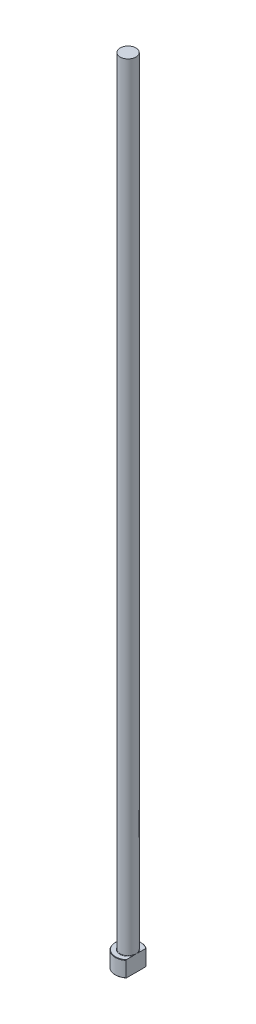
ISO-10303-21;
HEADER;
FILE_DESCRIPTION(('STEP AP214'),'2;1');
FILE_NAME('part.step','',(''),(''),'','','');
FILE_SCHEMA(('AUTOMOTIVE_DESIGN { 1 0 10303 214 1 1 1 1 }'));
ENDSEC;
DATA;
#1=APPLICATION_CONTEXT('core data for automotive mechanical design processes');
#2=APPLICATION_PROTOCOL_DEFINITION('international standard','automotive_design',2000,#1);
#3=PRODUCT_CONTEXT('',#1,'mechanical');
#4=PRODUCT('Part','Part','',(#3));
#5=PRODUCT_RELATED_PRODUCT_CATEGORY('part','',(#4));
#6=PRODUCT_DEFINITION_FORMATION('','',#4);
#7=PRODUCT_DEFINITION_CONTEXT('part definition',#1,'design');
#8=PRODUCT_DEFINITION('design','',#6,#7);
#9=PRODUCT_DEFINITION_SHAPE('','',#8);
#10=(LENGTH_UNIT() NAMED_UNIT(*) SI_UNIT(.MILLI.,.METRE.));
#11=(NAMED_UNIT(*) PLANE_ANGLE_UNIT() SI_UNIT($,.RADIAN.));
#12=(NAMED_UNIT(*) SI_UNIT($,.STERADIAN.) SOLID_ANGLE_UNIT());
#13=UNCERTAINTY_MEASURE_WITH_UNIT(LENGTH_MEASURE(1.E-05),#10,'distance_accuracy_value','');
#14=(GEOMETRIC_REPRESENTATION_CONTEXT(3) GLOBAL_UNCERTAINTY_ASSIGNED_CONTEXT((#13)) GLOBAL_UNIT_ASSIGNED_CONTEXT((#10,
#11,#12)) REPRESENTATION_CONTEXT('',''));
#15=CARTESIAN_POINT('',(0.,0.,0.));
#16=DIRECTION('',(0.,0.,1.));
#17=DIRECTION('',(1.,0.,0.));
#18=AXIS2_PLACEMENT_3D('',#15,#16,#17);
#19=CARTESIAN_POINT('',(0.,0.,0.));
#20=DIRECTION('',(0.,-1.,0.));
#21=DIRECTION('',(0.,0.,-1.));
#22=AXIS2_PLACEMENT_3D('',#19,#20,#21);
#23=PLANE('',#22);
#24=CARTESIAN_POINT('',(0.,0.,0.));
#25=DIRECTION('',(0.,-1.,0.));
#26=DIRECTION('',(0.,0.,-1.));
#27=AXIS2_PLACEMENT_3D('',#24,#25,#26);
#28=CIRCLE('',#27,6.30000000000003);
#29=CARTESIAN_POINT('',(3.99999999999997,0.,4.86723740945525));
#30=VERTEX_POINT('',#29);
#31=CARTESIAN_POINT('',(3.99999999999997,0.,-4.86723740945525));
#32=VERTEX_POINT('',#31);
#33=EDGE_CURVE('E98',#30,#32,#28,.T.);
#34=ORIENTED_EDGE('',*,*,#33,.T.);
#35=DIRECTION('',(0.,0.,1.));
#36=VECTOR('',#35,1.);
#37=CARTESIAN_POINT('',(3.99999999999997,0.,5.12347538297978));
#38=LINE('',#37,#36);
#39=EDGE_CURVE('E83',#32,#30,#38,.T.);
#40=ORIENTED_EDGE('',*,*,#39,.T.);
#41=EDGE_LOOP('',(#34,#40));
#42=FACE_BOUND('',#41,.T.);
#43=ADVANCED_FACE('F32',(#42),#23,.T.);
#44=CARTESIAN_POINT('',(0.,259.958771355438,0.));
#45=DIRECTION('',(0.,1.,0.));
#46=DIRECTION('',(0.,0.,1.));
#47=AXIS2_PLACEMENT_3D('',#44,#45,#46);
#48=CYLINDRICAL_SURFACE('',#47,6.49999999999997);
#49=CARTESIAN_POINT('',(0.,7.80000000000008,0.));
#50=DIRECTION('',(0.,1.,0.));
#51=DIRECTION('',(0.,0.,1.));
#52=AXIS2_PLACEMENT_3D('',#49,#50,#51);
#53=CIRCLE('',#52,6.49999999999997);
#54=CARTESIAN_POINT('',(3.99999999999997,7.80000000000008,5.12347538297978));
#55=VERTEX_POINT('',#54);
#56=CARTESIAN_POINT('',(3.99999999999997,7.80000000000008,-5.12347538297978));
#57=VERTEX_POINT('',#56);
#58=EDGE_CURVE('E104',#55,#57,#53,.F.);
#59=ORIENTED_EDGE('',*,*,#58,.T.);
#60=DIRECTION('',(0.,-1.,0.));
#61=VECTOR('',#60,1.);
#62=CARTESIAN_POINT('',(3.99999999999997,400.,-5.12347538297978));
#63=LINE('',#62,#61);
#64=CARTESIAN_POINT('',(3.99999999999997,0.199999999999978,-5.12347538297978));
#65=VERTEX_POINT('',#64);
#66=EDGE_CURVE('E183',#57,#65,#63,.T.);
#67=ORIENTED_EDGE('',*,*,#66,.T.);
#68=CARTESIAN_POINT('',(0.,0.199999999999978,0.));
#69=DIRECTION('',(0.,-1.,0.));
#70=DIRECTION('',(0.,0.,-1.));
#71=AXIS2_PLACEMENT_3D('',#68,#69,#70);
#72=CIRCLE('',#71,6.49999999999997);
#73=CARTESIAN_POINT('',(3.99999999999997,0.199999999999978,5.12347538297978));
#74=VERTEX_POINT('',#73);
#75=EDGE_CURVE('E100',#65,#74,#72,.F.);
#76=ORIENTED_EDGE('',*,*,#75,.T.);
#77=DIRECTION('',(0.,-1.,0.));
#78=VECTOR('',#77,1.);
#79=CARTESIAN_POINT('',(3.99999999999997,400.,5.12347538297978));
#80=LINE('',#79,#78);
#81=EDGE_CURVE('E93',#55,#74,#80,.T.);
#82=ORIENTED_EDGE('',*,*,#81,.F.);
#83=EDGE_LOOP('',(#59,#67,#76,#82));
#84=FACE_BOUND('',#83,.T.);
#85=ADVANCED_FACE('F158',(#84),#48,.T.);
#86=CARTESIAN_POINT('',(-6.49999999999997,8.,0.));
#87=DIRECTION('',(0.,1.,0.));
#88=DIRECTION('',(0.,0.,1.));
#89=AXIS2_PLACEMENT_3D('',#86,#87,#88);
#90=PLANE('',#89);
#91=CARTESIAN_POINT('',(0.,8.,0.));
#92=DIRECTION('',(0.,1.,0.));
#93=DIRECTION('',(0.,0.,1.));
#94=AXIS2_PLACEMENT_3D('',#91,#92,#93);
#95=CIRCLE('',#94,6.30000000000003);
#96=CARTESIAN_POINT('',(3.99999999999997,8.,-4.86723740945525));
#97=VERTEX_POINT('',#96);
#98=CARTESIAN_POINT('',(3.99999999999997,8.,4.86723740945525));
#99=VERTEX_POINT('',#98);
#100=EDGE_CURVE('E178',#97,#99,#95,.T.);
#101=ORIENTED_EDGE('',*,*,#100,.T.);
#102=DIRECTION('',(0.,0.,-1.));
#103=VECTOR('',#102,1.);
#104=CARTESIAN_POINT('',(3.99999999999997,8.,0.));
#105=LINE('',#104,#103);
#106=CARTESIAN_POINT('',(3.99999999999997,7.99999999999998,1.28062484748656));
#107=VERTEX_POINT('',#106);
#108=EDGE_CURVE('E57',#99,#107,#105,.T.);
#109=ORIENTED_EDGE('',*,*,#108,.T.);
#110=CARTESIAN_POINT('',(0.,8.,0.));
#111=DIRECTION('',(0.,1.,0.));
#112=DIRECTION('',(0.,0.,1.));
#113=AXIS2_PLACEMENT_3D('',#110,#111,#112);
#114=CIRCLE('',#113,4.19999999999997);
#115=CARTESIAN_POINT('',(3.99999999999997,7.99999999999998,-1.28062484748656));
#116=VERTEX_POINT('',#115);
#117=EDGE_CURVE('E107',#107,#116,#114,.F.);
#118=ORIENTED_EDGE('',*,*,#117,.T.);
#119=EDGE_CURVE('E136',#116,#97,#105,.T.);
#120=ORIENTED_EDGE('',*,*,#119,.T.);
#121=EDGE_LOOP('',(#101,#109,#118,#120));
#122=FACE_BOUND('',#121,.T.);
#123=ADVANCED_FACE('F147',(#122),#90,.T.);
#124=CARTESIAN_POINT('',(0.,8.00000000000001,0.));
#125=DIRECTION('',(0.,-1.,0.));
#126=DIRECTION('',(0.,0.,-1.));
#127=AXIS2_PLACEMENT_3D('',#124,#125,#126);
#128=CONICAL_SURFACE('',#127,6.30000000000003,0.785398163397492);
#129=ORIENTED_EDGE('',*,*,#58,.F.);
#130=CARTESIAN_POINT('',(3.99999999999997,2.33835680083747,11.2730168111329));
#131=CARTESIAN_POINT('',(3.99999999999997,2.5075110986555,11.0935258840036));
#132=CARTESIAN_POINT('',(3.99999999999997,2.67643005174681,10.9138129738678));
#133=CARTESIAN_POINT('',(3.99999999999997,3.01371694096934,10.5538688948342));
#134=CARTESIAN_POINT('',(3.99999999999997,3.1820848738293,10.3736377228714));
#135=CARTESIAN_POINT('',(3.99999999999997,3.68651578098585,9.83176085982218));
#136=CARTESIAN_POINT('',(3.99999999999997,4.02162663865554,9.46922758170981));
#137=CARTESIAN_POINT('',(3.99999999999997,4.69839264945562,8.73004878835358));
#138=CARTESIAN_POINT('',(3.99999999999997,5.03994227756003,8.35330632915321));
#139=CARTESIAN_POINT('',(3.99999999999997,5.54813444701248,7.78474717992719));
#140=CARTESIAN_POINT('',(3.99999999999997,5.71678224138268,7.59472329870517));
#141=CARTESIAN_POINT('',(3.99999999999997,6.05243048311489,7.21322727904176));
#142=CARTESIAN_POINT('',(3.99999999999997,6.21943094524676,7.02175515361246));
#143=CARTESIAN_POINT('',(3.99999999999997,6.55125779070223,6.63720143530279));
#144=CARTESIAN_POINT('',(3.99999999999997,6.71608581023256,6.44412125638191));
#145=CARTESIAN_POINT('',(3.99999999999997,7.04317390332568,6.05578163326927));
#146=CARTESIAN_POINT('',(3.99999999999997,7.20543388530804,5.86052211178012));
#147=CARTESIAN_POINT('',(3.99999999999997,7.5270272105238,5.46681806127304));
#148=CARTESIAN_POINT('',(3.99999999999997,7.68635259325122,5.26836701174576));
#149=CARTESIAN_POINT('',(3.99999999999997,8.0006074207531,4.86803282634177));
#150=CARTESIAN_POINT('',(3.99999999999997,8.15553731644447,4.66615004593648));
#151=CARTESIAN_POINT('',(3.99999999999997,8.45751575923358,4.26060182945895));
#152=CARTESIAN_POINT('',(3.99999999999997,8.60464039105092,4.05699334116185));
#153=CARTESIAN_POINT('',(3.99999999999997,8.89099959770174,3.64409822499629));
#154=CARTESIAN_POINT('',(3.99999999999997,9.0302302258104,3.43480883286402));
#155=CARTESIAN_POINT('',(3.99999999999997,9.2967735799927,3.00991388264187));
#156=CARTESIAN_POINT('',(3.99999999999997,9.42413322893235,2.79433803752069));
#157=CARTESIAN_POINT('',(3.99999999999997,9.66227069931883,2.35430355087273));
#158=CARTESIAN_POINT('',(3.99999999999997,9.77306978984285,2.12985677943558));
#159=CARTESIAN_POINT('',(3.99999999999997,9.92324174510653,1.77981866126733));
#160=CARTESIAN_POINT('',(3.99999999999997,9.97150219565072,1.65804958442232));
#161=CARTESIAN_POINT('',(3.99999999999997,10.0598239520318,1.41150602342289));
#162=CARTESIAN_POINT('',(3.99999999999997,10.0998835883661,1.28673093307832));
#163=CARTESIAN_POINT('',(3.99999999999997,10.1699893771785,1.03512545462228));
#164=CARTESIAN_POINT('',(3.99999999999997,10.2000910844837,0.908310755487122));
#165=CARTESIAN_POINT('',(3.99999999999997,10.2490705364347,0.65251155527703));
#166=CARTESIAN_POINT('',(3.99999999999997,10.2679495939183,0.523527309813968));
#167=CARTESIAN_POINT('',(3.99999999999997,10.2934980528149,0.262809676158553));
#168=CARTESIAN_POINT('',(3.99999999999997,10.3000223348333,0.13106177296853));
#169=CARTESIAN_POINT('',(3.99999999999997,10.2999775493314,-0.132423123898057));
#170=CARTESIAN_POINT('',(3.99999999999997,10.2934092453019,-0.264160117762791));
#171=CARTESIAN_POINT('',(3.99999999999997,10.2675780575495,-0.526867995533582));
#172=CARTESIAN_POINT('',(3.99999999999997,10.2482669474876,-0.65783405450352));
#173=CARTESIAN_POINT('',(3.99999999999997,10.1980980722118,-0.917527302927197));
#174=CARTESIAN_POINT('',(3.99999999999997,10.1672371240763,-1.04625386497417));
#175=CARTESIAN_POINT('',(3.99999999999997,10.0805844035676,-1.35405733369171));
#176=CARTESIAN_POINT('',(3.99999999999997,10.0197633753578,-1.5317103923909));
#177=CARTESIAN_POINT('',(3.99999999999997,9.88274788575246,-1.88095872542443));
#178=CARTESIAN_POINT('',(3.99999999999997,9.80654370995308,-2.05255009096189));
#179=CARTESIAN_POINT('',(3.99999999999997,9.68319777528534,-2.30659899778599));
#180=CARTESIAN_POINT('',(3.99999999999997,9.6403195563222,-2.39117275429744));
#181=CARTESIAN_POINT('',(3.99999999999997,9.55202002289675,-2.55898629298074));
#182=CARTESIAN_POINT('',(3.99999999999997,9.50659867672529,-2.64222605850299));
#183=CARTESIAN_POINT('',(3.99999999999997,9.41358656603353,-2.80743574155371));
#184=CARTESIAN_POINT('',(3.99999999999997,9.36599667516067,-2.88940615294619));
#185=CARTESIAN_POINT('',(3.99999999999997,9.26892422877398,-3.05220990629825));
#186=CARTESIAN_POINT('',(3.99999999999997,9.21944176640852,-3.13304330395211));
#187=CARTESIAN_POINT('',(3.99999999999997,9.04529267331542,-3.41112924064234));
#188=CARTESIAN_POINT('',(3.99999999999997,8.91648308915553,-3.60579191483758));
#189=CARTESIAN_POINT('',(3.99999999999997,8.65175618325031,-3.99024288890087));
#190=CARTESIAN_POINT('',(3.99999999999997,8.51583685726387,-4.18002979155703));
#191=CARTESIAN_POINT('',(3.99999999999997,8.23863283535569,-4.55590680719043));
#192=CARTESIAN_POINT('',(3.99999999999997,8.09734319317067,-4.74199325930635));
#193=CARTESIAN_POINT('',(3.99999999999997,7.81082146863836,-5.11106130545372));
#194=CARTESIAN_POINT('',(3.99999999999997,7.6655898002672,-5.2940432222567));
#195=CARTESIAN_POINT('',(3.99999999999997,7.37148704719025,-5.65825720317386));
#196=CARTESIAN_POINT('',(3.99999999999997,7.22260377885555,-5.83947940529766));
#197=CARTESIAN_POINT('',(3.99999999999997,6.92240731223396,-6.19990198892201));
#198=CARTESIAN_POINT('',(3.99999999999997,6.77109406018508,-6.3791023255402));
#199=CARTESIAN_POINT('',(3.99999999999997,6.31443192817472,-6.9140438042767));
#200=CARTESIAN_POINT('',(3.99999999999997,6.00619978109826,-7.26732233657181));
#201=CARTESIAN_POINT('',(3.99999999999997,5.42019779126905,-7.92915827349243));
#202=CARTESIAN_POINT('',(3.99999999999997,5.1429789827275,-8.23820650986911));
#203=CARTESIAN_POINT('',(3.99999999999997,4.58554936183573,-8.85367584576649));
#204=CARTESIAN_POINT('',(3.99999999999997,4.30533810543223,-9.16009654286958));
#205=CARTESIAN_POINT('',(3.99999999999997,3.74491435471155,-9.76850943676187));
#206=CARTESIAN_POINT('',(3.99999999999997,3.46471907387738,-10.0705175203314));
#207=CARTESIAN_POINT('',(3.99999999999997,2.90267484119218,-10.6728856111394));
#208=CARTESIAN_POINT('',(3.99999999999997,2.62082621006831,-10.9732459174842));
#209=CARTESIAN_POINT('',(3.99999999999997,2.33835680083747,-11.2730168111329));
#210=B_SPLINE_CURVE_WITH_KNOTS('',3,(#130,#131,#132,#133,#134,#135,#136,#137,#138,#139,#140,
#141,#142,#143,#144,#145,#146,#147,#148,#149,#150,#151,#152,#153,#154,#155,#156,#157,#158,#159,
#160,#161,#162,#163,#164,#165,#166,#167,#168,#169,#170,#171,#172,#173,#174,#175,#176,#177,#178,
#179,#180,#181,#182,#183,#184,#185,#186,#187,#188,#189,#190,#191,#192,#193,#194,#195,#196,#197,
#198,#199,#200,#201,#202,#203,#204,#205,#206,#207,#208,#209),.UNSPECIFIED.,.F.,.F.,(4,2,2,2,2,2,
2,2,2,2,2,2,2,2,2,2,2,2,2,2,2,2,2,2,2,2,2,2,2,2,2,2,2,2,2,2,2,2,2,4),(0.,0.739913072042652,
1.47983052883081,2.96088564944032,4.486400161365,5.24860048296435,6.0107939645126,
6.77237616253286,7.53398545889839,8.29742301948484,9.06078197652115,9.8142547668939,
10.5681010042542,11.3188284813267,12.0685833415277,12.4613034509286,12.854103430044,
13.2446735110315,13.6351978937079,14.0302815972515,14.4253422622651,14.8219067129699,
15.218580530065,15.7809161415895,16.3436079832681,16.6280404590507,16.9124764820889,
17.1967989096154,17.481107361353,18.1811169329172,18.8813249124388,19.5821942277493,
20.2829902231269,20.9865751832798,21.6901757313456,23.0966141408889,24.3420866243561,
25.5877465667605,26.8236460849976,28.0593133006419),.UNSPECIFIED.);
#211=EDGE_CURVE('E135',#55,#99,#210,.T.);
#212=ORIENTED_EDGE('',*,*,#211,.T.);
#213=ORIENTED_EDGE('',*,*,#100,.F.);
#214=EDGE_CURVE('E127',#97,#57,#210,.T.);
#215=ORIENTED_EDGE('',*,*,#214,.T.);
#216=EDGE_LOOP('',(#129,#212,#213,#215));
#217=FACE_BOUND('',#216,.T.);
#218=ADVANCED_FACE('F143',(#217),#128,.T.);
#219=CARTESIAN_POINT('',(0.,0.199999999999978,0.));
#220=DIRECTION('',(0.,1.,0.));
#221=DIRECTION('',(0.,0.,1.));
#222=AXIS2_PLACEMENT_3D('',#219,#220,#221);
#223=CONICAL_SURFACE('',#222,6.49999999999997,0.785398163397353);
#224=ORIENTED_EDGE('',*,*,#75,.F.);
#225=CARTESIAN_POINT('',(3.99999999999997,5.66164319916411,-11.2730168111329));
#226=CARTESIAN_POINT('',(3.99999999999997,5.49248890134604,-11.0935258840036));
#227=CARTESIAN_POINT('',(3.99999999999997,5.32356994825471,-10.9138129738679));
#228=CARTESIAN_POINT('',(3.99999999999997,4.9862830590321,-10.5538688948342));
#229=CARTESIAN_POINT('',(3.99999999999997,4.81791512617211,-10.3736377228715));
#230=CARTESIAN_POINT('',(3.99999999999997,4.31348421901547,-9.8317608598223));
#231=CARTESIAN_POINT('',(3.99999999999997,3.97837336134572,-9.46922758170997));
#232=CARTESIAN_POINT('',(3.99999999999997,3.30160735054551,-8.73004878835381));
#233=CARTESIAN_POINT('',(3.99999999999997,2.96005772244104,-8.35330632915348));
#234=CARTESIAN_POINT('',(3.99999999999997,2.45186555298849,-7.78474717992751));
#235=CARTESIAN_POINT('',(3.99999999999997,2.28321775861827,-7.59472329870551));
#236=CARTESIAN_POINT('',(3.99999999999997,1.94756951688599,-7.21322727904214));
#237=CARTESIAN_POINT('',(3.99999999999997,1.78056905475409,-7.02175515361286));
#238=CARTESIAN_POINT('',(3.99999999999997,1.44874220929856,-6.63720143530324));
#239=CARTESIAN_POINT('',(3.99999999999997,1.2839141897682,-6.44412125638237));
#240=CARTESIAN_POINT('',(3.99999999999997,0.956826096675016,-6.05578163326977));
#241=CARTESIAN_POINT('',(3.99999999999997,0.794566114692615,-5.86052211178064));
#242=CARTESIAN_POINT('',(3.99999999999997,0.472972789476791,-5.4668180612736));
#243=CARTESIAN_POINT('',(3.99999999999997,0.313647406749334,-5.26836701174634));
#244=CARTESIAN_POINT('',(3.99999999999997,-0.000607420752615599,-4.86803282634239));
#245=CARTESIAN_POINT('',(3.99999999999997,-0.155537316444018,-4.66615004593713));
#246=CARTESIAN_POINT('',(3.99999999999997,-0.457515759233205,-4.26060182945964));
#247=CARTESIAN_POINT('',(3.99999999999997,-0.604640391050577,-4.05699334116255));
#248=CARTESIAN_POINT('',(3.99999999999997,-0.890999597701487,-3.64409822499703));
#249=CARTESIAN_POINT('',(3.99999999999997,-1.03023022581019,-3.43480883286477));
#250=CARTESIAN_POINT('',(3.99999999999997,-1.29677357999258,-3.00991388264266));
#251=CARTESIAN_POINT('',(3.99999999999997,-1.42413322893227,-2.7943380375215));
#252=CARTESIAN_POINT('',(3.99999999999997,-1.66227069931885,-2.35430355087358));
#253=CARTESIAN_POINT('',(3.99999999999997,-1.77306978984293,-2.12985677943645));
#254=CARTESIAN_POINT('',(3.99999999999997,-1.92324174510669,-1.77981866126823));
#255=CARTESIAN_POINT('',(3.99999999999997,-1.97150219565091,-1.65804958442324));
#256=CARTESIAN_POINT('',(3.99999999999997,-2.05982395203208,-1.41150602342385));
#257=CARTESIAN_POINT('',(3.99999999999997,-2.09988358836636,-1.28673093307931));
#258=CARTESIAN_POINT('',(3.99999999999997,-2.16998937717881,-1.03512545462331));
#259=CARTESIAN_POINT('',(3.99999999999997,-2.20009108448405,-0.908310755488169));
#260=CARTESIAN_POINT('',(3.99999999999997,-2.24907053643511,-0.652511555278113));
#261=CARTESIAN_POINT('',(3.99999999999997,-2.26794959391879,-0.523527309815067));
#262=CARTESIAN_POINT('',(3.99999999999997,-2.29349805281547,-0.262809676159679));
#263=CARTESIAN_POINT('',(3.99999999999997,-2.30002233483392,-0.131061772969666));
#264=CARTESIAN_POINT('',(3.99999999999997,-2.29997754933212,0.132423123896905));
#265=CARTESIAN_POINT('',(3.99999999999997,-2.29340924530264,0.264160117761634));
#266=CARTESIAN_POINT('',(3.99999999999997,-2.26757805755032,0.526867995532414));
#267=CARTESIAN_POINT('',(3.99999999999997,-2.24826694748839,0.657834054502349));
#268=CARTESIAN_POINT('',(3.99999999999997,-2.19809807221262,0.917527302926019));
#269=CARTESIAN_POINT('',(3.99999999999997,-2.16723712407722,1.04625386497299));
#270=CARTESIAN_POINT('',(3.99999999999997,-2.08058440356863,1.35405733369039));
#271=CARTESIAN_POINT('',(3.99999999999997,-2.01976337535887,1.53171039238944));
#272=CARTESIAN_POINT('',(3.99999999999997,-1.8827478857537,1.88095872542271));
#273=CARTESIAN_POINT('',(3.99999999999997,-1.80654370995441,2.05255009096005));
#274=CARTESIAN_POINT('',(3.99999999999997,-1.68319777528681,2.30659899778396));
#275=CARTESIAN_POINT('',(3.99999999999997,-1.64031955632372,2.39117275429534));
#276=CARTESIAN_POINT('',(3.99999999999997,-1.55202002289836,2.55898629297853));
#277=CARTESIAN_POINT('',(3.99999999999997,-1.50659867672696,2.64222605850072));
#278=CARTESIAN_POINT('',(3.99999999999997,-1.41358656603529,2.80743574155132));
#279=CARTESIAN_POINT('',(3.99999999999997,-1.36599667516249,2.88940615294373));
#280=CARTESIAN_POINT('',(3.99999999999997,-1.26892422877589,3.05220990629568));
#281=CARTESIAN_POINT('',(3.99999999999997,-1.21944176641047,3.13304330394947));
#282=CARTESIAN_POINT('',(3.99999999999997,-1.04529267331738,3.41112924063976));
#283=CARTESIAN_POINT('',(3.99999999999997,-0.916483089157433,3.60579191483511));
#284=CARTESIAN_POINT('',(3.99999999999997,-0.651756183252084,3.99024288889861));
#285=CARTESIAN_POINT('',(3.99999999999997,-0.515836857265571,4.18002979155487));
#286=CARTESIAN_POINT('',(3.99999999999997,-0.238632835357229,4.55590680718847));
#287=CARTESIAN_POINT('',(3.99999999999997,-0.0973431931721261,4.74199325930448));
#288=CARTESIAN_POINT('',(3.99999999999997,0.189178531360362,5.11106130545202));
#289=CARTESIAN_POINT('',(3.99999999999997,0.334410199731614,5.2940432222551));
#290=CARTESIAN_POINT('',(3.99999999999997,0.628512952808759,5.65825720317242));
#291=CARTESIAN_POINT('',(3.99999999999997,0.777396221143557,5.83947940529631));
#292=CARTESIAN_POINT('',(3.99999999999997,1.07759268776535,6.19990198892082));
#293=CARTESIAN_POINT('',(3.99999999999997,1.22890593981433,6.37910232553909));
#294=CARTESIAN_POINT('',(3.99999999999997,1.685568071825,6.91404380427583));
#295=CARTESIAN_POINT('',(3.99999999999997,1.99380021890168,7.26732233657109));
#296=CARTESIAN_POINT('',(3.99999999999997,2.57980220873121,7.92915827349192));
#297=CARTESIAN_POINT('',(3.99999999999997,2.85702101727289,8.23820650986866));
#298=CARTESIAN_POINT('',(3.99999999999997,3.4144506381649,8.85367584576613));
#299=CARTESIAN_POINT('',(3.99999999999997,3.69466189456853,9.16009654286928));
#300=CARTESIAN_POINT('',(3.99999999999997,4.25508564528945,9.76850943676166));
#301=CARTESIAN_POINT('',(3.99999999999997,4.53528092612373,10.0705175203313));
#302=CARTESIAN_POINT('',(3.99999999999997,5.09732515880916,10.6728856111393));
#303=CARTESIAN_POINT('',(3.99999999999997,5.37917378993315,10.9732459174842));
#304=CARTESIAN_POINT('',(3.99999999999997,5.66164319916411,11.2730168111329));
#305=B_SPLINE_CURVE_WITH_KNOTS('',3,(#225,#226,#227,#228,#229,#230,#231,#232,#233,#234,#235,
#236,#237,#238,#239,#240,#241,#242,#243,#244,#245,#246,#247,#248,#249,#250,#251,#252,#253,#254,
#255,#256,#257,#258,#259,#260,#261,#262,#263,#264,#265,#266,#267,#268,#269,#270,#271,#272,#273,
#274,#275,#276,#277,#278,#279,#280,#281,#282,#283,#284,#285,#286,#287,#288,#289,#290,#291,#292,
#293,#294,#295,#296,#297,#298,#299,#300,#301,#302,#303,#304),.UNSPECIFIED.,.F.,.F.,(4,2,2,2,2,2,
2,2,2,2,2,2,2,2,2,2,2,2,2,2,2,2,2,2,2,2,2,2,2,2,2,2,2,2,2,2,2,2,2,4),(0.,0.739913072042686,
1.47983052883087,2.96088564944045,4.48640016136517,5.24860048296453,6.0107939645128,
6.77237616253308,7.53398545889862,8.29742301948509,9.06078197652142,9.81425476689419,
10.5681010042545,11.3188284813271,12.0685833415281,12.4613034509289,12.8541034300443,
13.2446735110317,13.6351978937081,14.0302815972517,14.4253422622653,14.8219067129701,
15.2185805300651,15.7809161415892,16.3436079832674,16.6280404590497,16.9124764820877,
17.196798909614,17.4811073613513,18.1811169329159,18.8813249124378,19.5821942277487,
20.2829902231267,20.98657518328,21.6901757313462,23.0966141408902,24.3420866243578,
25.5877465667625,26.823646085,28.0593133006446),.UNSPECIFIED.);
#306=EDGE_CURVE('E86',#65,#32,#305,.T.);
#307=ORIENTED_EDGE('',*,*,#306,.T.);
#308=ORIENTED_EDGE('',*,*,#33,.F.);
#309=EDGE_CURVE('E89',#30,#74,#305,.T.);
#310=ORIENTED_EDGE('',*,*,#309,.T.);
#311=EDGE_LOOP('',(#224,#307,#308,#310));
#312=FACE_BOUND('',#311,.T.);
#313=ADVANCED_FACE('F97',(#312),#223,.T.);
#314=CARTESIAN_POINT('',(0.,8.19999999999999,0.));
#315=DIRECTION('',(0.,1.,0.));
#316=DIRECTION('',(0.,0.,1.));
#317=AXIS2_PLACEMENT_3D('',#314,#315,#316);
#318=TOROIDAL_SURFACE('',#317,4.19999999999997,0.2);
#319=CARTESIAN_POINT('',(3.99999999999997,8.19999999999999,0.));
#320=CARTESIAN_POINT('',(3.99999999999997,8.20000051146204,6.54993054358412E-12));
#321=CARTESIAN_POINT('',(3.99999999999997,8.20000102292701,-2.33849533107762E-07));
#322=CARTESIAN_POINT('',(3.99999999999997,8.20000197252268,-8.59106931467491E-07));
#323=CARTESIAN_POINT('',(3.99999999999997,8.20000239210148,-1.26721109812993E-06));
#324=CARTESIAN_POINT('',(3.99999999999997,8.20000328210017,-2.25074280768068E-06));
#325=CARTESIAN_POINT('',(3.99999999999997,8.20000373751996,-2.84212519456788E-06));
#326=CARTESIAN_POINT('',(3.99999999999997,8.20000453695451,-4.05328052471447E-06));
#327=CARTESIAN_POINT('',(3.99999999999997,8.20000488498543,-4.67066382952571E-06));
#328=CARTESIAN_POINT('',(3.99999999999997,8.20000621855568,-7.11716611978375E-06));
#329=CARTESIAN_POINT('',(3.99999999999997,8.20000713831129,-8.98558487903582E-06));
#330=CARTESIAN_POINT('',(3.99999999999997,8.20000861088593,-1.26418243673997E-05));
#331=CARTESIAN_POINT('',(3.99999999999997,8.2000091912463,-1.44189480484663E-05));
#332=CARTESIAN_POINT('',(3.99999999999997,8.20001169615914,-2.20915838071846E-05));
#333=CARTESIAN_POINT('',(3.99999999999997,8.20001361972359,-2.79894750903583E-05));
#334=CARTESIAN_POINT('',(3.99999999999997,8.20001638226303,-3.90228536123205E-05));
#335=CARTESIAN_POINT('',(3.99999999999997,8.20001734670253,-4.41264580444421E-05));
#336=CARTESIAN_POINT('',(3.99999999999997,8.20002447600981,-8.24800902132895E-05));
#337=CARTESIAN_POINT('',(3.99999999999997,8.20003000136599,-0.000115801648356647));
#338=CARTESIAN_POINT('',(3.99999999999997,8.2000541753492,-0.000248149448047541));
#339=CARTESIAN_POINT('',(3.99999999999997,8.200077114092,-0.000346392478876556));
#340=CARTESIAN_POINT('',(3.99999999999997,8.20016695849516,-0.000737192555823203));
#341=CARTESIAN_POINT('',(3.99999999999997,8.20023118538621,-0.00103015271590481));
#342=CARTESIAN_POINT('',(3.99999999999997,8.20048943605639,-0.00220000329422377));
#343=CARTESIAN_POINT('',(3.99999999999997,8.20068689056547,-0.00307635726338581));
#344=CARTESIAN_POINT('',(3.99999999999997,8.20151245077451,-0.00674945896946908));
#345=CARTESIAN_POINT('',(3.99999999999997,8.20213623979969,-0.00954688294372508));
#346=CARTESIAN_POINT('',(3.99999999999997,8.21069858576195,-0.0479346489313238));
#347=CARTESIAN_POINT('',(3.99999999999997,8.21866411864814,-0.0835210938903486));
#348=CARTESIAN_POINT('',(3.99999999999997,8.23536251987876,-0.158673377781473));
#349=CARTESIAN_POINT('',(3.99999999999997,8.24408230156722,-0.198242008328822));
#350=CARTESIAN_POINT('',(3.99999999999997,8.25875222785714,-0.265746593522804));
#351=CARTESIAN_POINT('',(3.99999999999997,8.26476038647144,-0.293669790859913));
#352=CARTESIAN_POINT('',(3.99999999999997,8.27645424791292,-0.348796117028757));
#353=CARTESIAN_POINT('',(3.99999999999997,8.28214427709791,-0.375998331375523));
#354=CARTESIAN_POINT('',(3.99999999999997,8.30043795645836,-0.465036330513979));
#355=CARTESIAN_POINT('',(3.99999999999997,8.31263876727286,-0.526956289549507));
#356=CARTESIAN_POINT('',(3.99999999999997,8.33561275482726,-0.65168218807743));
#357=CARTESIAN_POINT('',(3.99999999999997,8.34637105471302,-0.714490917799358));
#358=CARTESIAN_POINT('',(3.99999999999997,8.36658245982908,-0.846543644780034));
#359=CARTESIAN_POINT('',(3.99999999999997,8.37580902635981,-0.915823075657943));
#360=CARTESIAN_POINT('',(3.99999999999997,8.39039845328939,-1.05460878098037));
#361=CARTESIAN_POINT('',(3.99999999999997,8.39577328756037,-1.1241136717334));
#362=CARTESIAN_POINT('',(3.99999999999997,8.39959291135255,-1.22750409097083));
#363=CARTESIAN_POINT('',(3.99999999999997,8.40018074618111,-1.26130913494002));
#364=CARTESIAN_POINT('',(3.99999999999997,8.39972074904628,-1.32890426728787));
#365=CARTESIAN_POINT('',(3.99999999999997,8.39867346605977,-1.36269435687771));
#366=CARTESIAN_POINT('',(3.99999999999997,8.3945557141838,-1.42954089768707));
#367=CARTESIAN_POINT('',(3.99999999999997,8.39152235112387,-1.46259952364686));
#368=CARTESIAN_POINT('',(3.99999999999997,8.38286512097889,-1.52835908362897));
#369=CARTESIAN_POINT('',(3.99999999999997,8.37724516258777,-1.56106048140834));
#370=CARTESIAN_POINT('',(3.99999999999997,8.36402263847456,-1.61846409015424));
#371=CARTESIAN_POINT('',(3.99999999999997,8.3571375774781,-1.64332989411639));
#372=CARTESIAN_POINT('',(3.99999999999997,8.3402719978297,-1.69212725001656));
#373=CARTESIAN_POINT('',(3.99999999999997,8.33028876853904,-1.71605796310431));
#374=CARTESIAN_POINT('',(3.99999999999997,8.31168601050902,-1.75008824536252));
#375=CARTESIAN_POINT('',(3.99999999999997,8.30485398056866,-1.76115159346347));
#376=CARTESIAN_POINT('',(3.99999999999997,8.28960114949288,-1.78210611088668));
#377=CARTESIAN_POINT('',(3.99999999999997,8.28118962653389,-1.79200360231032));
#378=CARTESIAN_POINT('',(3.99999999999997,8.26737388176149,-1.80493475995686));
#379=CARTESIAN_POINT('',(3.99999999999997,8.26276322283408,-1.80881084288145));
#380=CARTESIAN_POINT('',(3.99999999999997,8.25306023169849,-1.81592390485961));
#381=CARTESIAN_POINT('',(3.99999999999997,8.24796771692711,-1.81916064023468));
#382=CARTESIAN_POINT('',(3.99999999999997,8.237244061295,-1.8248051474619));
#383=CARTESIAN_POINT('',(3.99999999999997,8.23160666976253,-1.82720134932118));
#384=CARTESIAN_POINT('',(3.99999999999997,8.21997194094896,-1.8308361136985));
#385=CARTESIAN_POINT('',(3.99999999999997,8.21397550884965,-1.83207746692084));
#386=CARTESIAN_POINT('',(3.99999999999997,8.20263132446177,-1.83315692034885));
#387=CARTESIAN_POINT('',(3.99999999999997,8.19729868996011,-1.8331541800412));
#388=CARTESIAN_POINT('',(3.99999999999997,8.18672944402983,-1.83214057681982));
#389=CARTESIAN_POINT('',(3.99999999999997,8.18149289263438,-1.83112910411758));
#390=CARTESIAN_POINT('',(3.99999999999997,8.17078487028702,-1.82806907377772));
#391=CARTESIAN_POINT('',(3.99999999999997,8.16533999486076,-1.82592931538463));
#392=CARTESIAN_POINT('',(3.99999999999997,8.15487296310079,-1.82079411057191));
#393=CARTESIAN_POINT('',(3.99999999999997,8.14985146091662,-1.81779737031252));
#394=CARTESIAN_POINT('',(3.99999999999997,8.13773920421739,-1.80942140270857));
#395=CARTESIAN_POINT('',(3.99999999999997,8.13094534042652,-1.80361715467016));
#396=CARTESIAN_POINT('',(3.99999999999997,8.11830005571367,-1.79106454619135));
#397=CARTESIAN_POINT('',(3.99999999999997,8.11245134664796,-1.78431356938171));
#398=CARTESIAN_POINT('',(3.99999999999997,8.09656788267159,-1.76377799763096));
#399=CARTESIAN_POINT('',(3.99999999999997,8.08757958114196,-1.7491934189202));
#400=CARTESIAN_POINT('',(3.99999999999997,8.07165230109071,-1.71899459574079));
#401=CARTESIAN_POINT('',(3.99999999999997,8.06471615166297,-1.70337896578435));
#402=CARTESIAN_POINT('',(3.99999999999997,8.0496464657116,-1.66459665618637));
#403=CARTESIAN_POINT('',(3.99999999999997,8.04232016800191,-1.64111968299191));
#404=CARTESIAN_POINT('',(3.99999999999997,8.02986383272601,-1.59357415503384));
#405=CARTESIAN_POINT('',(3.99999999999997,8.02473853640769,-1.56950444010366));
#406=CARTESIAN_POINT('',(3.99999999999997,8.01610324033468,-1.52067485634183));
#407=CARTESIAN_POINT('',(3.99999999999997,8.01262117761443,-1.49591014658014));
#408=CARTESIAN_POINT('',(3.99999999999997,8.00704256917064,-1.44626562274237));
#409=CARTESIAN_POINT('',(3.99999999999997,8.00494421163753,-1.42138600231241));
#410=CARTESIAN_POINT('',(3.99999999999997,8.00075077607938,-1.35341124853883));
#411=CARTESIAN_POINT('',(3.99999999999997,7.99977133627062,-1.31024782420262));
#412=CARTESIAN_POINT('',(3.99999999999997,8.00031303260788,-1.22392963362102));
#413=CARTESIAN_POINT('',(3.99999999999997,8.00183577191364,-1.18077489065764));
#414=CARTESIAN_POINT('',(3.99999999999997,8.00931890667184,-1.05109835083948));
#415=CARTESIAN_POINT('',(3.99999999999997,8.01820648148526,-0.964749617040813));
#416=CARTESIAN_POINT('',(3.99999999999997,8.03989342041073,-0.80020089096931));
#417=CARTESIAN_POINT('',(3.99999999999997,8.05228816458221,-0.72194180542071));
#418=CARTESIAN_POINT('',(3.99999999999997,8.07962880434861,-0.566748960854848));
#419=CARTESIAN_POINT('',(3.99999999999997,8.09454562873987,-0.489810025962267));
#420=CARTESIAN_POINT('',(3.99999999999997,8.11594630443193,-0.385191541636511));
#421=CARTESIAN_POINT('',(3.99999999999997,8.12174621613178,-0.357366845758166));
#422=CARTESIAN_POINT('',(3.99999999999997,8.13367824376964,-0.300962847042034));
#423=CARTESIAN_POINT('',(3.99999999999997,8.13981511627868,-0.272384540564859));
#424=CARTESIAN_POINT('',(3.99999999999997,8.15483459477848,-0.203169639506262));
#425=CARTESIAN_POINT('',(3.99999999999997,8.16378036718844,-0.162546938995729));
#426=CARTESIAN_POINT('',(3.99999999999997,8.1809159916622,-0.085400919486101));
#427=CARTESIAN_POINT('',(3.99999999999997,8.18909179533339,-0.0488746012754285));
#428=CARTESIAN_POINT('',(3.99999999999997,8.1978638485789,-0.00954647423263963));
#429=CARTESIAN_POINT('',(3.99999999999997,8.1984877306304,-0.00674864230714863));
#430=CARTESIAN_POINT('',(3.99999999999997,8.19931331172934,-0.00307545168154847));
#431=CARTESIAN_POINT('',(3.99999999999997,8.19951069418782,-0.00219941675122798));
#432=CARTESIAN_POINT('',(3.99999999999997,8.19976885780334,-0.00102996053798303));
#433=CARTESIAN_POINT('',(3.99999999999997,8.1998330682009,-0.000737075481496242));
#434=CARTESIAN_POINT('',(3.99999999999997,8.19992289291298,-0.000346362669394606));
#435=CARTESIAN_POINT('',(3.99999999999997,8.19994582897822,-0.00024813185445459));
#436=CARTESIAN_POINT('',(3.99999999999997,8.19997000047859,-0.000115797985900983));
#437=CARTESIAN_POINT('',(3.99999999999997,8.19997552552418,-8.24780560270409E-05));
#438=CARTESIAN_POINT('',(3.99999999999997,8.19998265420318,-4.41260942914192E-05));
#439=CARTESIAN_POINT('',(3.99999999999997,8.19998361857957,-3.90225731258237E-05));
#440=CARTESIAN_POINT('',(3.99999999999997,8.1999863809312,-2.79893708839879E-05));
#441=CARTESIAN_POINT('',(3.99999999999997,8.19998830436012,-2.20915682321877E-05));
#442=CARTESIAN_POINT('',(3.99999999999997,8.19999080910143,-1.44190257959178E-05));
#443=CARTESIAN_POINT('',(3.99999999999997,8.19999138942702,-1.26419080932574E-05));
#444=CARTESIAN_POINT('',(3.99999999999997,8.19999286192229,-8.98567539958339E-06));
#445=CARTESIAN_POINT('',(3.99999999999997,8.19999378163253,-7.11725658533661E-06));
#446=CARTESIAN_POINT('',(3.99999999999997,8.19999511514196,-4.6707483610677E-06));
#447=CARTESIAN_POINT('',(3.99999999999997,8.19999546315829,-4.05336158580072E-06));
#448=CARTESIAN_POINT('',(3.99999999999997,8.19999626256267,-2.84219668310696E-06));
#449=CARTESIAN_POINT('',(3.99999999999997,8.19999671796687,-2.25080806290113E-06));
#450=CARTESIAN_POINT('',(3.99999999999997,8.19999760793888,-1.26726205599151E-06));
#451=CARTESIAN_POINT('',(3.99999999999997,8.1999980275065,-8.59150422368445E-07));
#452=CARTESIAN_POINT('',(3.99999999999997,8.1999989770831,-2.33873767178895E-07));
#453=CARTESIAN_POINT('',(3.99999999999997,8.19999948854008,-6.5499030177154E-12));
#454=CARTESIAN_POINT('',(3.99999999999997,8.19999999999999,0.));
#455=B_SPLINE_CURVE_WITH_KNOTS('',3,(#319,#320,#321,#322,#323,#324,#325,#326,#327,#328,#329,
#330,#331,#332,#333,#334,#335,#336,#337,#338,#339,#340,#341,#342,#343,#344,#345,#346,#347,#348,
#349,#350,#351,#352,#353,#354,#355,#356,#357,#358,#359,#360,#361,#362,#363,#364,#365,#366,#367,
#368,#369,#370,#371,#372,#373,#374,#375,#376,#377,#378,#379,#380,#381,#382,#383,#384,#385,#386,
#387,#388,#389,#390,#391,#392,#393,#394,#395,#396,#397,#398,#399,#400,#401,#402,#403,#404,#405,
#406,#407,#408,#409,#410,#411,#412,#413,#414,#415,#416,#417,#418,#419,#420,#421,#422,#423,#424,
#425,#426,#427,#428,#429,#430,#431,#432,#433,#434,#435,#436,#437,#438,#439,#440,#441,#442,#443,
#444,#445,#446,#447,#448,#449,#450,#451,#452,#453,#454),.UNSPECIFIED.,.T.,.F.,(4,2,2,2,2,2,2,2,
2,2,2,2,2,2,2,2,2,2,2,2,2,2,2,2,2,2,2,2,2,2,2,2,2,2,2,2,2,2,2,2,2,2,2,2,2,2,2,2,2,2,2,2,2,2,2,2,
2,2,2,2,2,2,2,2,2,2,2,4),(0.,1.56012555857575E-06,3.32588802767E-06,5.54921805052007E-06,
7.67484495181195E-06,1.39023129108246E-05,1.95054925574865E-05,3.80905014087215E-05,
5.36549268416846E-05,0.000155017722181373,0.000457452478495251,0.00135744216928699,
0.00405212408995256,0.01265083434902,0.122049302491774,0.243603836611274,0.329290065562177,
0.412662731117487,0.601981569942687,0.793123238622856,1.00273287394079,1.21168803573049,
1.31308928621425,1.41445649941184,1.51398193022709,1.61335745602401,1.69066291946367,
1.76803621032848,1.80696120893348,1.84566433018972,1.86369438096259,1.88173129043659,
1.90000754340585,1.91823951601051,1.93413978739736,1.95004967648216,1.96750510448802,
1.98498702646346,2.01164257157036,2.03837328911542,2.0894803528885,2.14065754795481,
2.21426121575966,2.28802264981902,2.36299656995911,2.43787212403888,2.56728534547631,
2.69678151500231,2.95692568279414,3.19457926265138,3.4296600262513,3.51492857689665,
3.60261719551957,3.72740578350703,3.83969348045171,3.84829344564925,3.85098714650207,
3.85188690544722,3.85218930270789,3.85229066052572,3.8523062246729,3.85232480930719,
3.85233041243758,3.85233663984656,3.85233876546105,3.85234098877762,3.85234275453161,
3.85234431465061),.UNSPECIFIED.);
#456=CARTESIAN_POINT('',(3.99999999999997,8.19999999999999,0.));
#457=VERTEX_POINT('',#456);
#458=EDGE_CURVE('E11',#116,#457,#455,.T.);
#459=ORIENTED_EDGE('',*,*,#458,.F.);
#460=ORIENTED_EDGE('',*,*,#117,.F.);
#461=CARTESIAN_POINT('',(3.99999999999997,8.19999999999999,0.));
#462=CARTESIAN_POINT('',(3.99999999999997,8.19999948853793,-6.54999323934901E-12));
#463=CARTESIAN_POINT('',(3.99999999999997,8.19999897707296,2.33849532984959E-07));
#464=CARTESIAN_POINT('',(3.99999999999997,8.19999802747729,8.59106931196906E-07));
#465=CARTESIAN_POINT('',(3.99999999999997,8.19999760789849,1.26721109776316E-06));
#466=CARTESIAN_POINT('',(3.99999999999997,8.1999967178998,2.25074280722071E-06));
#467=CARTESIAN_POINT('',(3.99999999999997,8.19999626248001,2.84212519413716E-06));
#468=CARTESIAN_POINT('',(3.99999999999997,8.19999546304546,4.05328052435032E-06));
#469=CARTESIAN_POINT('',(3.99999999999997,8.19999511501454,4.67066382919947E-06));
#470=CARTESIAN_POINT('',(3.99999999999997,8.19999378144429,7.11716611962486E-06));
#471=CARTESIAN_POINT('',(3.99999999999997,8.19999286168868,8.98558487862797E-06));
#472=CARTESIAN_POINT('',(3.99999999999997,8.19999138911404,1.26418243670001E-05));
#473=CARTESIAN_POINT('',(3.99999999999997,8.19999080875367,1.44189480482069E-05));
#474=CARTESIAN_POINT('',(3.99999999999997,8.19998830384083,2.20915838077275E-05));
#475=CARTESIAN_POINT('',(3.99999999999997,8.19998638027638,2.79894750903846E-05));
#476=CARTESIAN_POINT('',(3.99999999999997,8.19998361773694,3.90228536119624E-05));
#477=CARTESIAN_POINT('',(3.99999999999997,8.19998265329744,4.41264580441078E-05));
#478=CARTESIAN_POINT('',(3.99999999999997,8.19997552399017,8.24800902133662E-05));
#479=CARTESIAN_POINT('',(3.99999999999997,8.19996999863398,0.000115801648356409));
#480=CARTESIAN_POINT('',(3.99999999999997,8.19994582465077,0.000248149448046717));
#481=CARTESIAN_POINT('',(3.99999999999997,8.19992288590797,0.000346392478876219));
#482=CARTESIAN_POINT('',(3.99999999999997,8.19983304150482,0.000737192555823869));
#483=CARTESIAN_POINT('',(3.99999999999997,8.19976881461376,0.00103015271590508));
#484=CARTESIAN_POINT('',(3.99999999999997,8.19951056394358,0.00220000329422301));
#485=CARTESIAN_POINT('',(3.99999999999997,8.1993131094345,0.00307635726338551));
#486=CARTESIAN_POINT('',(3.99999999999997,8.19848754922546,0.00674945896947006));
#487=CARTESIAN_POINT('',(3.99999999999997,8.19786376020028,0.00954688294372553));
#488=CARTESIAN_POINT('',(3.99999999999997,8.18930141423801,0.047934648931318));
#489=CARTESIAN_POINT('',(3.99999999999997,8.18133588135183,0.083521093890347));
#490=CARTESIAN_POINT('',(3.99999999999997,8.16463748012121,0.158673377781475));
#491=CARTESIAN_POINT('',(3.99999999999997,8.15591769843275,0.198242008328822));
#492=CARTESIAN_POINT('',(3.99999999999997,8.14124777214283,0.265746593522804));
#493=CARTESIAN_POINT('',(3.99999999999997,8.13523961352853,0.293669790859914));
#494=CARTESIAN_POINT('',(3.99999999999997,8.12354575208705,0.348796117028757));
#495=CARTESIAN_POINT('',(3.99999999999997,8.11785572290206,0.375998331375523));
#496=CARTESIAN_POINT('',(3.99999999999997,8.09956204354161,0.465036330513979));
#497=CARTESIAN_POINT('',(3.99999999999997,8.08736123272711,0.526956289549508));
#498=CARTESIAN_POINT('',(3.99999999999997,8.06438724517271,0.65168218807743));
#499=CARTESIAN_POINT('',(3.99999999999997,8.05362894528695,0.714490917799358));
#500=CARTESIAN_POINT('',(3.99999999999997,8.03341754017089,0.846543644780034));
#501=CARTESIAN_POINT('',(3.99999999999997,8.02419097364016,0.915823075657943));
#502=CARTESIAN_POINT('',(3.99999999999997,8.00960154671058,1.05460878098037));
#503=CARTESIAN_POINT('',(3.99999999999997,8.0042267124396,1.1241136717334));
#504=CARTESIAN_POINT('',(3.99999999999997,8.00040708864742,1.22750409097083));
#505=CARTESIAN_POINT('',(3.99999999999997,7.99981925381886,1.26130913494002));
#506=CARTESIAN_POINT('',(3.99999999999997,8.00027925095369,1.32890426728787));
#507=CARTESIAN_POINT('',(3.99999999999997,8.0013265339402,1.36269435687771));
#508=CARTESIAN_POINT('',(3.99999999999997,8.00544428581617,1.42954089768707));
#509=CARTESIAN_POINT('',(3.99999999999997,8.0084776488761,1.46259952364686));
#510=CARTESIAN_POINT('',(3.99999999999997,8.01713487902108,1.52835908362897));
#511=CARTESIAN_POINT('',(3.99999999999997,8.0227548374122,1.56106048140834));
#512=CARTESIAN_POINT('',(3.99999999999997,8.03597736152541,1.61846409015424));
#513=CARTESIAN_POINT('',(3.99999999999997,8.04286242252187,1.64332989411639));
#514=CARTESIAN_POINT('',(3.99999999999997,8.05972800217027,1.69212725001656));
#515=CARTESIAN_POINT('',(3.99999999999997,8.06971123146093,1.71605796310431));
#516=CARTESIAN_POINT('',(3.99999999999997,8.08831398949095,1.75008824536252));
#517=CARTESIAN_POINT('',(3.99999999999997,8.09514601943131,1.76115159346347));
#518=CARTESIAN_POINT('',(3.99999999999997,8.11039885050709,1.78210611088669));
#519=CARTESIAN_POINT('',(3.99999999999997,8.11881037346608,1.79200360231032));
#520=CARTESIAN_POINT('',(3.99999999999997,8.13262611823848,1.80493475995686));
#521=CARTESIAN_POINT('',(3.99999999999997,8.13723677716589,1.80881084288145));
#522=CARTESIAN_POINT('',(3.99999999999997,8.14693976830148,1.81592390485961));
#523=CARTESIAN_POINT('',(3.99999999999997,8.15203228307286,1.81916064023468));
#524=CARTESIAN_POINT('',(3.99999999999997,8.16275593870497,1.8248051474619));
#525=CARTESIAN_POINT('',(3.99999999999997,8.16839333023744,1.82720134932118));
#526=CARTESIAN_POINT('',(3.99999999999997,8.18002805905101,1.8308361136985));
#527=CARTESIAN_POINT('',(3.99999999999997,8.18602449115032,1.83207746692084));
#528=CARTESIAN_POINT('',(3.99999999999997,8.1973686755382,1.83315692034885));
#529=CARTESIAN_POINT('',(3.99999999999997,8.20270131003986,1.8331541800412));
#530=CARTESIAN_POINT('',(3.99999999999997,8.21327055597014,1.83214057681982));
#531=CARTESIAN_POINT('',(3.99999999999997,8.21850710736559,1.83112910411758));
#532=CARTESIAN_POINT('',(3.99999999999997,8.22921512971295,1.82806907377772));
#533=CARTESIAN_POINT('',(3.99999999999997,8.23466000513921,1.82592931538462));
#534=CARTESIAN_POINT('',(3.99999999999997,8.24512703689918,1.82079411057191));
#535=CARTESIAN_POINT('',(3.99999999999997,8.25014853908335,1.81779737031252));
#536=CARTESIAN_POINT('',(3.99999999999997,8.26226079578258,1.80942140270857));
#537=CARTESIAN_POINT('',(3.99999999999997,8.26905465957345,1.80361715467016));
#538=CARTESIAN_POINT('',(3.99999999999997,8.2816999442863,1.79106454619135));
#539=CARTESIAN_POINT('',(3.99999999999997,8.28754865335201,1.78431356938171));
#540=CARTESIAN_POINT('',(3.99999999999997,8.30343211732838,1.76377799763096));
#541=CARTESIAN_POINT('',(3.99999999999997,8.31242041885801,1.7491934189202));
#542=CARTESIAN_POINT('',(3.99999999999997,8.32834769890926,1.71899459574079));
#543=CARTESIAN_POINT('',(3.99999999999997,8.335283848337,1.70337896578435));
#544=CARTESIAN_POINT('',(3.99999999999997,8.35035353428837,1.66459665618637));
#545=CARTESIAN_POINT('',(3.99999999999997,8.35767983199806,1.64111968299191));
#546=CARTESIAN_POINT('',(3.99999999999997,8.37013616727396,1.59357415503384));
#547=CARTESIAN_POINT('',(3.99999999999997,8.37526146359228,1.56950444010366));
#548=CARTESIAN_POINT('',(3.99999999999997,8.38389675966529,1.52067485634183));
#549=CARTESIAN_POINT('',(3.99999999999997,8.38737882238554,1.49591014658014));
#550=CARTESIAN_POINT('',(3.99999999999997,8.39295743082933,1.44626562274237));
#551=CARTESIAN_POINT('',(3.99999999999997,8.39505578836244,1.42138600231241));
#552=CARTESIAN_POINT('',(3.99999999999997,8.39924922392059,1.35341124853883));
#553=CARTESIAN_POINT('',(3.99999999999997,8.40022866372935,1.31024782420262));
#554=CARTESIAN_POINT('',(3.99999999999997,8.39968696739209,1.22392963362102));
#555=CARTESIAN_POINT('',(3.99999999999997,8.39816422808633,1.18077489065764));
#556=CARTESIAN_POINT('',(3.99999999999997,8.39068109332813,1.05109835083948));
#557=CARTESIAN_POINT('',(3.99999999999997,8.38179351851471,0.964749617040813));
#558=CARTESIAN_POINT('',(3.99999999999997,8.36010657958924,0.80020089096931));
#559=CARTESIAN_POINT('',(3.99999999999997,8.34771183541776,0.72194180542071));
#560=CARTESIAN_POINT('',(3.99999999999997,8.32037119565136,0.566748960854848));
#561=CARTESIAN_POINT('',(3.99999999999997,8.3054543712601,0.489810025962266));
#562=CARTESIAN_POINT('',(3.99999999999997,8.28405369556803,0.385191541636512));
#563=CARTESIAN_POINT('',(3.99999999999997,8.27825378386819,0.357366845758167));
#564=CARTESIAN_POINT('',(3.99999999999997,8.26632175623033,0.300962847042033));
#565=CARTESIAN_POINT('',(3.99999999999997,8.2601848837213,0.272384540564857));
#566=CARTESIAN_POINT('',(3.99999999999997,8.24516540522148,0.203169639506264));
#567=CARTESIAN_POINT('',(3.99999999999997,8.23621963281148,0.162546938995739));
#568=CARTESIAN_POINT('',(3.99999999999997,8.21908400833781,0.0854009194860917));
#569=CARTESIAN_POINT('',(3.99999999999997,8.21090820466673,0.0488746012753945));
#570=CARTESIAN_POINT('',(3.99999999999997,8.20213615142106,0.00954647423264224));
#571=CARTESIAN_POINT('',(3.99999999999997,8.20151226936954,0.00674864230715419));
#572=CARTESIAN_POINT('',(3.99999999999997,8.20068668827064,0.00307545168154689));
#573=CARTESIAN_POINT('',(3.99999999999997,8.20048930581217,0.00219941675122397));
#574=CARTESIAN_POINT('',(3.99999999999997,8.20023114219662,0.00102996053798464));
#575=CARTESIAN_POINT('',(3.99999999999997,8.20016693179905,0.000737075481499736));
#576=CARTESIAN_POINT('',(3.99999999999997,8.20007710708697,0.000346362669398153));
#577=CARTESIAN_POINT('',(3.99999999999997,8.20005417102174,0.000248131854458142));
#578=CARTESIAN_POINT('',(3.99999999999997,8.20002999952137,0.000115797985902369));
#579=CARTESIAN_POINT('',(3.99999999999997,8.20002447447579,8.24780560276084E-05));
#580=CARTESIAN_POINT('',(3.99999999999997,8.20001734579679,4.41260942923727E-05));
#581=CARTESIAN_POINT('',(3.99999999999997,8.20001638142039,3.90225731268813E-05));
#582=CARTESIAN_POINT('',(3.99999999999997,8.20001361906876,2.79893708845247E-05));
#583=CARTESIAN_POINT('',(3.99999999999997,8.20001169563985,2.20915682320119E-05));
#584=CARTESIAN_POINT('',(3.99999999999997,8.20000919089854,1.44190257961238E-05));
#585=CARTESIAN_POINT('',(3.99999999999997,8.20000861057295,1.26419080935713E-05));
#586=CARTESIAN_POINT('',(3.99999999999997,8.20000713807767,8.98567540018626E-06));
#587=CARTESIAN_POINT('',(3.99999999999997,8.20000621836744,7.11725658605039E-06));
#588=CARTESIAN_POINT('',(3.99999999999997,8.20000488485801,4.67074836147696E-06));
#589=CARTESIAN_POINT('',(3.99999999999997,8.20000453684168,4.05336158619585E-06));
#590=CARTESIAN_POINT('',(3.99999999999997,8.2000037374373,2.84219668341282E-06));
#591=CARTESIAN_POINT('',(3.99999999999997,8.2000032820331,2.25080806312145E-06));
#592=CARTESIAN_POINT('',(3.99999999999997,8.20000239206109,1.26726205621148E-06));
#593=CARTESIAN_POINT('',(3.99999999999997,8.20000197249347,8.59150422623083E-07));
#594=CARTESIAN_POINT('',(3.99999999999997,8.20000102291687,2.33873767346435E-07));
#595=CARTESIAN_POINT('',(3.99999999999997,8.20000051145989,6.54996571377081E-12));
#596=CARTESIAN_POINT('',(3.99999999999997,8.19999999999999,0.));
#597=B_SPLINE_CURVE_WITH_KNOTS('',3,(#461,#462,#463,#464,#465,#466,#467,#468,#469,#470,#471,
#472,#473,#474,#475,#476,#477,#478,#479,#480,#481,#482,#483,#484,#485,#486,#487,#488,#489,#490,
#491,#492,#493,#494,#495,#496,#497,#498,#499,#500,#501,#502,#503,#504,#505,#506,#507,#508,#509,
#510,#511,#512,#513,#514,#515,#516,#517,#518,#519,#520,#521,#522,#523,#524,#525,#526,#527,#528,
#529,#530,#531,#532,#533,#534,#535,#536,#537,#538,#539,#540,#541,#542,#543,#544,#545,#546,#547,
#548,#549,#550,#551,#552,#553,#554,#555,#556,#557,#558,#559,#560,#561,#562,#563,#564,#565,#566,
#567,#568,#569,#570,#571,#572,#573,#574,#575,#576,#577,#578,#579,#580,#581,#582,#583,#584,#585,
#586,#587,#588,#589,#590,#591,#592,#593,#594,#595,#596),.UNSPECIFIED.,.T.,.F.,(4,2,2,2,2,2,2,2,
2,2,2,2,2,2,2,2,2,2,2,2,2,2,2,2,2,2,2,2,2,2,2,2,2,2,2,2,2,2,2,2,2,2,2,2,2,2,2,2,2,2,2,2,2,2,2,2,
2,2,2,2,2,2,2,2,2,2,2,4),(0.,1.5601255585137E-06,3.32588802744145E-06,5.54921805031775E-06,
7.67484495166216E-06,1.390231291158E-05,1.95054925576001E-05,3.80905014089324E-05,
5.36549268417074E-05,0.00015501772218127,0.000457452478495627,0.00135744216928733,
0.0040521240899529,0.0126508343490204,0.122049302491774,0.243603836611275,0.329290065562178,
0.412662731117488,0.601981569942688,0.793123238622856,1.00273287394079,1.21168803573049,
1.31308928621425,1.41445649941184,1.51398193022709,1.61335745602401,1.69066291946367,
1.76803621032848,1.80696120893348,1.84566433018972,1.86369438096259,1.88173129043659,
1.90000754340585,1.91823951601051,1.93413978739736,1.95004967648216,1.96750510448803,
1.98498702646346,2.01164257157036,2.03837328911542,2.0894803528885,2.14065754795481,
2.21426121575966,2.28802264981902,2.36299656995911,2.43787212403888,2.56728534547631,
2.69678151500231,2.95692568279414,3.19457926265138,3.4296600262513,3.51492857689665,
3.60261719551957,3.72740578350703,3.83969348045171,3.84829344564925,3.85098714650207,
3.85188690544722,3.85218930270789,3.85229066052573,3.8523062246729,3.85232480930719,
3.85233041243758,3.85233663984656,3.85233876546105,3.85234098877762,3.85234275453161,
3.85234431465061),.UNSPECIFIED.);
#598=EDGE_CURVE('E46',#457,#107,#597,.T.);
#599=ORIENTED_EDGE('',*,*,#598,.F.);
#600=CARTESIAN_POINT('',(0.,8.19999999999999,0.));
#601=DIRECTION('',(0.,1.,0.));
#602=DIRECTION('',(0.,0.,1.));
#603=AXIS2_PLACEMENT_3D('',#600,#601,#602);
#604=CIRCLE('',#603,3.99999999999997);
#605=EDGE_CURVE('E103',#457,#457,#604,.T.);
#606=ORIENTED_EDGE('',*,*,#605,.F.);
#607=EDGE_LOOP('',(#459,#460,#599,#606));
#608=FACE_BOUND('',#607,.T.);
#609=ADVANCED_FACE('F34',(#608),#318,.F.);
#610=CARTESIAN_POINT('',(0.,259.958771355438,0.));
#611=DIRECTION('',(0.,1.,0.));
#612=DIRECTION('',(0.,0.,1.));
#613=AXIS2_PLACEMENT_3D('',#610,#611,#612);
#614=CYLINDRICAL_SURFACE('',#613,3.99999999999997);
#615=ORIENTED_EDGE('',*,*,#605,.T.);
#616=EDGE_LOOP('',(#615));
#617=FACE_BOUND('',#616,.T.);
#618=CARTESIAN_POINT('',(0.,400.,0.));
#619=DIRECTION('',(0.,1.,0.));
#620=DIRECTION('',(0.,0.,1.));
#621=AXIS2_PLACEMENT_3D('',#618,#619,#620);
#622=CIRCLE('',#621,3.99999999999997);
#623=CARTESIAN_POINT('',(0.,400.,3.99999999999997));
#624=VERTEX_POINT('',#623);
#625=EDGE_CURVE('E101',#624,#624,#622,.T.);
#626=ORIENTED_EDGE('',*,*,#625,.F.);
#627=EDGE_LOOP('',(#626));
#628=FACE_BOUND('',#627,.T.);
#629=ADVANCED_FACE('F155',(#617,#628),#614,.T.);
#630=CARTESIAN_POINT('',(-3.99999999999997,400.,0.));
#631=DIRECTION('',(0.,1.,0.));
#632=DIRECTION('',(0.,0.,1.));
#633=AXIS2_PLACEMENT_3D('',#630,#631,#632);
#634=PLANE('',#633);
#635=ORIENTED_EDGE('',*,*,#625,.T.);
#636=EDGE_LOOP('',(#635));
#637=FACE_BOUND('',#636,.T.);
#638=ADVANCED_FACE('F121',(#637),#634,.T.);
#639=CARTESIAN_POINT('',(3.99999999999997,400.,5.12347538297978));
#640=DIRECTION('',(1.,0.,0.));
#641=DIRECTION('',(0.,0.,-1.));
#642=AXIS2_PLACEMENT_3D('',#639,#640,#641);
#643=PLANE('',#642);
#644=ORIENTED_EDGE('',*,*,#66,.F.);
#645=ORIENTED_EDGE('',*,*,#214,.F.);
#646=ORIENTED_EDGE('',*,*,#119,.F.);
#647=ORIENTED_EDGE('',*,*,#458,.T.);
#648=ORIENTED_EDGE('',*,*,#598,.T.);
#649=ORIENTED_EDGE('',*,*,#108,.F.);
#650=ORIENTED_EDGE('',*,*,#211,.F.);
#651=ORIENTED_EDGE('',*,*,#81,.T.);
#652=ORIENTED_EDGE('',*,*,#309,.F.);
#653=ORIENTED_EDGE('',*,*,#39,.F.);
#654=ORIENTED_EDGE('',*,*,#306,.F.);
#655=EDGE_LOOP('',(#644,#645,#646,#647,#648,#649,#650,#651,#652,#653,#654));
#656=FACE_BOUND('',#655,.T.);
#657=ADVANCED_FACE('F85',(#656),#643,.T.);
#658=CLOSED_SHELL('',(#43,#85,#123,#218,#313,#609,#629,#638,#657));
#659=MANIFOLD_SOLID_BREP('B2',#658);
#660=ADVANCED_BREP_SHAPE_REPRESENTATION('',(#18,#659),#14);
#661=SHAPE_DEFINITION_REPRESENTATION(#9,#660);
ENDSEC;
END-ISO-10303-21;
